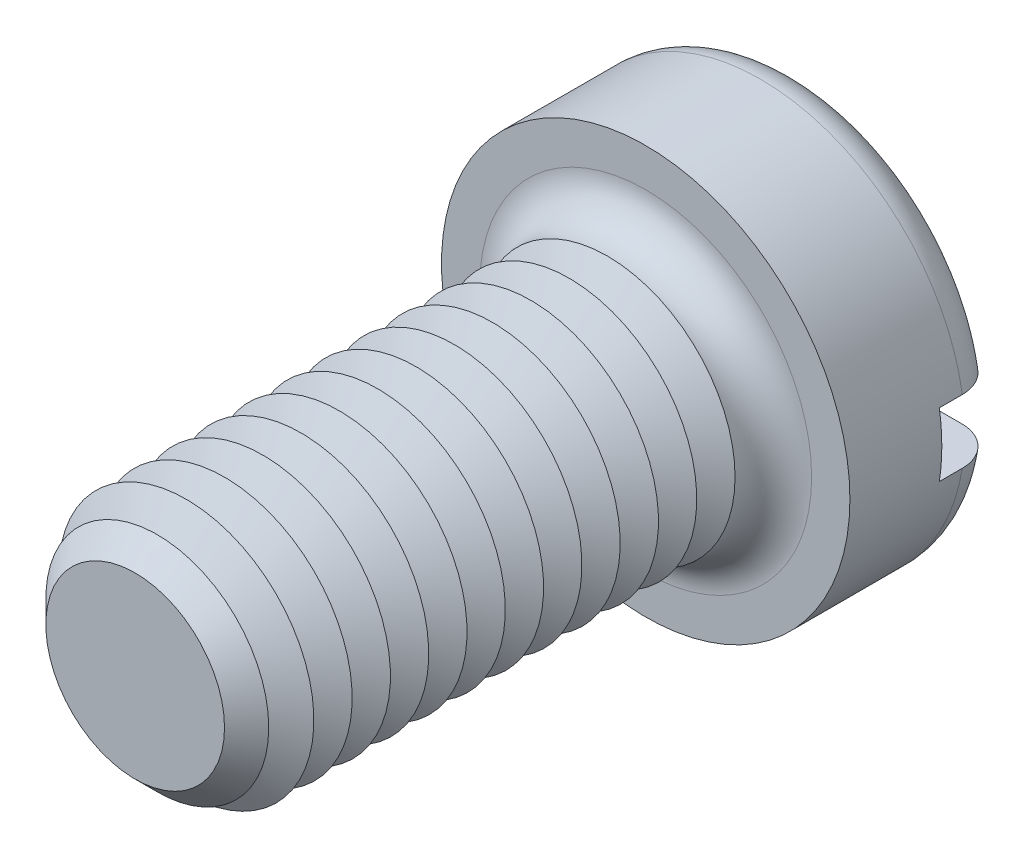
from build123d import *

# Parameters (mm, degrees)
SKETCH3_R           = 8
BOSS_EXTRUDE2_DEPTH = 6
SKETCH4_R           = 5
BOSS_EXTRUDE3_DEPTH = 20
FILLET1_R           = 1.5
CHAMFER1_SIZE       = 1.5
LPATTERN1_COUNT     = 12
LPATTERN1_PITCH     = 1.5
SKETCH8_W           = 16
SKETCH8_H           = 2.5
CUT_EXTRUDE1_DEPTH  = 2.4


with BuildPart() as part:
    # Sketch3 → Boss-Extrude2 (new body)
    with BuildSketch(Plane.XY):
        Circle(SKETCH3_R)
    extrude(amount=-BOSS_EXTRUDE2_DEPTH)

    # Sketch4 → Boss-Extrude3 (add)
    with BuildSketch(Plane.XY):
        Circle(SKETCH4_R)
    extrude(amount=BOSS_EXTRUDE3_DEPTH)

    # Fillet1
    fillet1_edges = [part.edges().sort_by_distance(p)[0] for p in [
        (-8, 0, -6),
        (-5, 0, 0),
    ]]
    fillet(fillet1_edges, radius=FILLET1_R)

    # Chamfer1
    chamfer1_edges = [part.edges().sort_by_distance(p)[0] for p in [
        (-5, 0, 20),
    ]]
    chamfer(chamfer1_edges, length=CHAMFER1_SIZE)

    # Sketch6 → Cut-Revolve1 (revolve, cut)
    with BuildSketch(Plane(origin=(0, 0, 0), x_dir=(0, 0, -1), z_dir=(1, 0, 0)), mode=Mode.PRIVATE) as cut_revolve1_sk:
        Polygon((-1.5, 5), (-2.25, 3.700961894), (-3, 5), align=None)
    cut_revolve1 = revolve(cut_revolve1_sk.sketch.rotate(Axis((0, 0, -1.694361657), (0, 0, 1)), 90), axis=Axis((0, 0, -1.694361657), (0, 0, 1)), mode=Mode.SUBTRACT)

    # LPattern1: Cut-Revolve1 ×12
    with Locations(*[(0, 0, i * LPATTERN1_PITCH) for i in range(1, LPATTERN1_COUNT)]):
        add(cut_revolve1, mode=Mode.SUBTRACT)

    # Sketch8 → Cut-Extrude1 (cut)
    with BuildSketch(Plane(origin=(0, 0, -6), x_dir=(-1, 0, 0), z_dir=(0, 0, -1))):
        Rectangle(SKETCH8_W, SKETCH8_H)
    extrude(amount=-CUT_EXTRUDE1_DEPTH, mode=Mode.SUBTRACT)


solid = part.part
